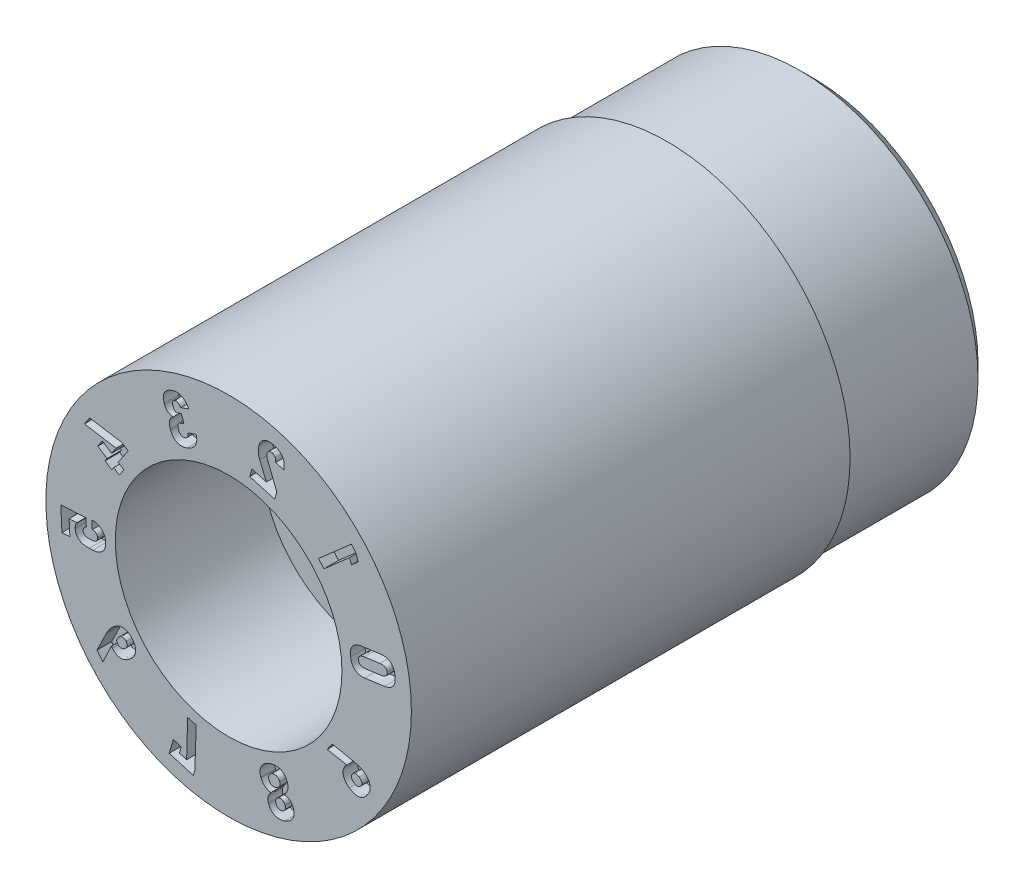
from build123d import *

# Parameters (mm, degrees)
SKETCH4_W          = 2
SKETCH4_H          = 1
CUT_EXTRUDE1_DEPTH = 0.2


with BuildPart() as part:
    # Sketch1 → Revolve1 (revolve)
    with BuildSketch(Plane(origin=(0, 0, 0), x_dir=(0, 0, -1), z_dir=(1, 0, 0)), mode=Mode.PRIVATE) as revolve1_sk:
        Polygon((0, 2.5), (0, 1.55), (2, 1.55), (2, 0.8), (8, 0.8), (8, 2.25), (7.75, 2.5), align=None)
    revolve(revolve1_sk.sketch.rotate(Axis((0, 0, 3.797909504), (0, 0, -1)), 90), axis=Axis((0, 0, 3.797909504), (0, 0, -1)))

    # Sketch4 → Cut-Revolve1 (revolve, cut)
    with BuildSketch(Plane(origin=(0, 0, 0), x_dir=(0, 0, -1), z_dir=(1, 0, 0)), mode=Mode.PRIVATE) as cut_revolve1_sk:
        with Locations((7, 2.935)):
            Rectangle(SKETCH4_W, SKETCH4_H)
    revolve(cut_revolve1_sk.sketch.rotate(Axis((0, 0, 0), (0, 0, -1)), 90), axis=Axis((0, 0, 0), (0, 0, -1)), mode=Mode.SUBTRACT)

    # Sketch6 → Cut-Extrude1 (cut)
    # profile 1 of 10: a face of its own
    with BuildSketch(Plane.XY):
        with BuildLine():
            Line((1.861146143, 0.075596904), (2.131380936, 0.11295078))
            add(Edge.make_bspline(
                [(2.131380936, 0.11295078), (2.144006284, 0.114856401), (2.16249984, 0.118359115), (2.185447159, 0.126664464), (2.201025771, 0.133735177), (2.215151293, 0.142395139), (2.228138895, 0.152100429), (2.239721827, 0.163182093), (2.249926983, 0.175526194), (2.258659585, 0.189055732), (2.265992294, 0.203677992), (2.271567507, 0.219458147), (2.275598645, 0.236316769), (2.278038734, 0.25424988), (2.279141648, 0.280326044), (2.277817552, 0.300406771), (2.275777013, 0.314015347)],
                knots=[0, 0, 0, 0, 0.136085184, 0.199106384, 0.259270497, 0.317759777, 0.37500963, 0.431454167, 0.487863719, 0.545010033, 0.602410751, 0.661485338, 0.72263664, 0.786518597, 0.853705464, 1, 1, 1, 1], degree=3))
            add(Edge.make_bspline(
                [(2.275777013, 0.314015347), (2.273803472, 0.327683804), (2.269967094, 0.347525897), (2.261790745, 0.372400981), (2.254564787, 0.389037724), (2.246152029, 0.404231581), (2.236398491, 0.417856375), (2.225585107, 0.430063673), (2.213533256, 0.440701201), (2.200369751, 0.449682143), (2.18636457, 0.457355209), (2.171245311, 0.463042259), (2.155307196, 0.467594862), (2.138359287, 0.470240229), (2.113893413, 0.471662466), (2.095087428, 0.47052806), (2.082355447, 0.468698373)],
                knots=[0, 0, 0, 0, 0.146845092, 0.214046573, 0.277872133, 0.339327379, 0.39823759, 0.455574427, 0.512279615, 0.568566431, 0.624619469, 0.681531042, 0.739841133, 0.800492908, 0.863366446, 1, 1, 1, 1], degree=3))
            Line((2.082355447, 0.468698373), (1.812120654, 0.431344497))
            add(Edge.make_bspline(
                [(1.812120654, 0.431344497), (1.799495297, 0.429438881), (1.781001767, 0.425936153), (1.758054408, 0.417630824), (1.742475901, 0.410560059), (1.728350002, 0.401900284), (1.715363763, 0.39219432), (1.703775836, 0.381115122), (1.693589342, 0.368761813), (1.684784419, 0.355264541), (1.677718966, 0.340506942), (1.672071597, 0.324760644), (1.668046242, 0.307892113), (1.665659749, 0.28994708), (1.66422147, 0.263870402), (1.666056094, 0.243784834), (1.667757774, 0.230162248)],
                knots=[0, 0, 0, 0, 0.136066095, 0.199078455, 0.259234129, 0.317715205, 0.374957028, 0.431393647, 0.487795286, 0.544933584, 0.60235899, 0.661425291, 0.722568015, 0.786441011, 0.853756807, 1, 1, 1, 1], degree=3))
            add(Edge.make_bspline(
                [(1.667757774, 0.230162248), (1.669802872, 0.21651949), (1.673436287, 0.19660243), (1.681934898, 0.171798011), (1.689022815, 0.155083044), (1.697689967, 0.140019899), (1.707345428, 0.126345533), (1.718316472, 0.114214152), (1.730475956, 0.103608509), (1.743751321, 0.094640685), (1.757899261, 0.087093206), (1.772984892, 0.08111419), (1.788992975, 0.076938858), (1.80578758, 0.074060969), (1.829988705, 0.072633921), (1.848571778, 0.073899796), (1.861146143, 0.075596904)],
                knots=[0, 0, 0, 0, 0.147056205, 0.214375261, 0.278722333, 0.339947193, 0.398942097, 0.456552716, 0.513575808, 0.570221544, 0.62666766, 0.683922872, 0.742464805, 0.802418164, 0.864972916, 1, 1, 1, 1], degree=3))
        make_face()
        with BuildLine():
            Line((1.856182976, 0.323334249), (2.069218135, 0.352683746))
            add(Edge.make_bspline(
                [(2.069218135, 0.352683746), (2.082011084, 0.354526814), (2.100577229, 0.355576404), (2.123617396, 0.351697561), (2.135633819, 0.347440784), (2.143813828, 0.342596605), (2.149235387, 0.338361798), (2.154049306, 0.333495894), (2.158225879, 0.327930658), (2.161610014, 0.321648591), (2.165294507, 0.312126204), (2.167001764, 0.304468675), (2.167780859, 0.299177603)],
                knots=[0, 0, 0, 0, 0.304027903, 0.431521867, 0.546510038, 0.600639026, 0.654019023, 0.70753598, 0.760830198, 0.816755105, 0.874435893, 1, 1, 1, 1], degree=3))
            add(Edge.make_bspline(
                [(2.167780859, 0.299177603), (2.168647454, 0.293868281), (2.168885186, 0.286054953), (2.167890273, 0.275936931), (2.166325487, 0.269001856), (2.163791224, 0.262537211), (2.16044172, 0.256582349), (2.156356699, 0.251080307), (2.149765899, 0.244184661), (2.139402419, 0.23671046), (2.118332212, 0.226522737), (2.100073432, 0.222835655), (2.087318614, 0.220961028)],
                knots=[0, 0, 0, 0, 0.125997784, 0.182684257, 0.238360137, 0.292332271, 0.345112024, 0.398323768, 0.452810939, 0.568510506, 0.695956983, 1, 1, 1, 1], degree=3))
            Line((2.087318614, 0.220961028), (1.874283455, 0.191611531))
            add(Edge.make_bspline(
                [(1.874283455, 0.191611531), (1.861452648, 0.18982522), (1.842882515, 0.188637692), (1.81981419, 0.19259307), (1.807858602, 0.196971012), (1.799657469, 0.201817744), (1.794262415, 0.206003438), (1.789548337, 0.210887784), (1.785411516, 0.216362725), (1.782054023, 0.222613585), (1.778139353, 0.23200655), (1.77657698, 0.239728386), (1.775753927, 0.244999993)],
                knots=[0, 0, 0, 0, 0.305399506, 0.432223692, 0.547953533, 0.602164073, 0.655624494, 0.707922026, 0.761296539, 0.816372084, 0.874242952, 1, 1, 1, 1], degree=3))
            add(Edge.make_bspline(
                [(1.775753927, 0.244999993), (1.774346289, 0.255039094), (1.77464878, 0.270216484), (1.782471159, 0.288124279), (1.791737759, 0.298878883), (1.804011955, 0.307523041), (1.825074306, 0.317785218), (1.843397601, 0.321432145), (1.856182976, 0.323334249)],
                knots=[0, 0, 0, 0, 0.239112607, 0.34504082, 0.452478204, 0.56778046, 0.695160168, 1, 1, 1, 1], degree=3))
        make_face(mode=Mode.SUBTRACT)
    # profile 2 of 10: a face of its own
    with BuildSketch(Plane.XY):
        Polygon((1.229514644, 1.176097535), (1.303909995, 1.091285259), (1.653796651, 1.398438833), (1.68118292, 1.325631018), (1.771031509, 1.404541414), (1.74245543, 1.498226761), (1.67887881, 1.570633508), align=None)
    # profile 3 of 10: a face of its own
    with BuildSketch(Plane.XY):
        with BuildLine():
            Line((0.658529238, 1.677527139), (0.534220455, 1.994587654))
            add(Edge.make_bspline(
                [(0.534220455, 1.994587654), (0.528803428, 2.007944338), (0.524246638, 2.025350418), (0.522754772, 2.046220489), (0.522984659, 2.058502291), (0.524383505, 2.067341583), (0.525900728, 2.072926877)],
                knots=[0, 0, 0, 0, 0.540331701, 0.666219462, 0.783312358, 1, 1, 1, 1], degree=3))
            add(Edge.make_bspline(
                [(0.525900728, 2.072926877), (0.528167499, 2.08077042), (0.532531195, 2.090825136), (0.542560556, 2.10080505), (0.551387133, 2.10597817), (0.561497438, 2.109229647), (0.577377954, 2.110827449), (0.589735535, 2.108376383), (0.598037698, 2.106078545)],
                knots=[0, 0, 0, 0, 0.245514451, 0.356498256, 0.468910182, 0.585213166, 0.70980326, 1, 1, 1, 1], degree=3))
            add(Edge.make_bspline(
                [(0.598037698, 2.106078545), (0.606286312, 2.103702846), (0.618243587, 2.098397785), (0.630250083, 2.086421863), (0.637222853, 2.076028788), (0.641964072, 2.063958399), (0.64554962, 2.045144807), (0.644329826, 2.030171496), (0.64272184, 2.020046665)],
                knots=[0, 0, 0, 0, 0.240931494, 0.353956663, 0.468879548, 0.58751771, 0.712959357, 1, 1, 1, 1], degree=3))
            Line((0.64272184, 2.020046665), (0.754291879, 1.987958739))
            add(Edge.make_bspline(
                [(0.754291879, 1.987958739), (0.758228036, 2.005699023), (0.761170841, 2.031489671), (0.759751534, 2.065260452), (0.755297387, 2.088588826), (0.748494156, 2.110527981), (0.738810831, 2.130790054), (0.726368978, 2.149179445), (0.711453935, 2.165800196), (0.694053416, 2.180455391), (0.667115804, 2.197390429), (0.644430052, 2.206299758), (0.62862663, 2.210811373)],
                knots=[0, 0, 0, 0, 0.185460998, 0.271331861, 0.354080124, 0.43423889, 0.512035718, 0.58907357, 0.666709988, 0.745913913, 0.827271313, 1, 1, 1, 1], degree=3))
            add(Edge.make_bspline(
                [(0.62862663, 2.210811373), (0.61180354, 2.215383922), (0.586854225, 2.220838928), (0.553964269, 2.221731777), (0.531482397, 2.219877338), (0.510496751, 2.215150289), (0.491115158, 2.20777096), (0.473478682, 2.197636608), (0.457747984, 2.184710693), (0.443733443, 2.169420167), (0.427457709, 2.144822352), (0.419239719, 2.123607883), (0.414948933, 2.108802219)],
                knots=[0, 0, 0, 0, 0.195014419, 0.28286785, 0.366387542, 0.446162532, 0.522132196, 0.597030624, 0.672126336, 0.748498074, 0.827697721, 1, 1, 1, 1], degree=3))
            add(Edge.make_bspline(
                [(0.414948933, 2.108802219), (0.411070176, 2.095190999), (0.407351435, 2.07492771), (0.405605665, 2.047354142), (0.406201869, 2.026315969), (0.408436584, 2.005338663), (0.413229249, 1.977879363), (0.419645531, 1.958009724), (0.424866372, 1.945211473)],
                knots=[0, 0, 0, 0, 0.245990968, 0.370324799, 0.497769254, 0.625118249, 0.750585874, 1, 1, 1, 1], degree=3))
            Line((0.424866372, 1.945211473), (0.5160938, 1.725264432))
            Line((0.5160938, 1.725264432), (0.318510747, 1.781245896))
            Line((0.318510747, 1.781245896), (0.288778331, 1.676270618))
            Line((0.288778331, 1.676270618), (0.630672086, 1.579300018))
            Line((0.630672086, 1.579300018), (0.658529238, 1.677527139))
        make_face()
    # profile 4 of 10: a face of its own
    with BuildSketch(Plane.XY):
        with BuildLine():
            Line((-0.444660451, 1.809894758), (-0.55503925, 1.770398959))
            add(Edge.make_bspline(
                [(-0.55503925, 1.770398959), (-0.553554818, 1.764614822), (-0.552886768, 1.755975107), (-0.553027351, 1.74466663), (-0.55448445, 1.736873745), (-0.55661121, 1.729476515), (-0.559722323, 1.722618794), (-0.563683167, 1.71634667), (-0.56832848, 1.710572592), (-0.573809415, 1.705375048), (-0.582576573, 1.699416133), (-0.589831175, 1.695785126), (-0.595052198, 1.69399068)],
                knots=[0, 0, 0, 0, 0.186572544, 0.271920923, 0.35462121, 0.434944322, 0.513458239, 0.590451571, 0.667604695, 0.745940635, 0.82692544, 1, 1, 1, 1], degree=3))
            add(Edge.make_bspline(
                [(-0.595052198, 1.69399068), (-0.604156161, 1.690801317), (-0.618081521, 1.687551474), (-0.636258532, 1.689468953), (-0.648283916, 1.693633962), (-0.659113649, 1.700489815), (-0.671900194, 1.713896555), (-0.678539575, 1.726702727), (-0.681688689, 1.736030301)],
                knots=[0, 0, 0, 0, 0.265794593, 0.382655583, 0.496402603, 0.611511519, 0.730293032, 1, 1, 1, 1], degree=3))
            Line((-0.681688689, 1.736030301), (-0.686487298, 1.74934746))
            add(Edge.make_bspline(
                [(-0.686487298, 1.74934746), (-0.689682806, 1.758966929), (-0.693879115, 1.773203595), (-0.693711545, 1.791882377), (-0.691460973, 1.803893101), (-0.686757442, 1.814489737), (-0.677033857, 1.826783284), (-0.666344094, 1.832542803), (-0.658855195, 1.835198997)],
                knots=[0, 0, 0, 0, 0.299684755, 0.427918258, 0.545279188, 0.656050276, 0.764944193, 1, 1, 1, 1], degree=3))
            Line((-0.658855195, 1.835198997), (-0.610810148, 1.852464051))
            Line((-0.610810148, 1.852464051), (-0.647714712, 1.955470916))
            Line((-0.647714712, 1.955470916), (-0.69575976, 1.938205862))
            add(Edge.make_bspline(
                [(-0.69575976, 1.938205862), (-0.701893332, 1.935884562), (-0.711707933, 1.934546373), (-0.724328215, 1.937541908), (-0.732905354, 1.942294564), (-0.740879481, 1.949078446), (-0.750799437, 1.961731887), (-0.75633488, 1.973137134), (-0.759172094, 1.981484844)],
                knots=[0, 0, 0, 0, 0.227214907, 0.333285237, 0.444905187, 0.564191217, 0.694311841, 1, 1, 1, 1], degree=3))
            Line((-0.759172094, 1.981484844), (-0.76258074, 1.991193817))
            add(Edge.make_bspline(
                [(-0.76258074, 1.991193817), (-0.765168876, 1.999018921), (-0.768514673, 2.010741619), (-0.767661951, 2.026115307), (-0.7650804, 2.036050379), (-0.760535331, 2.044900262), (-0.751416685, 2.055228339), (-0.742034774, 2.060347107), (-0.73529079, 2.062659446)],
                knots=[0, 0, 0, 0, 0.287470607, 0.41213855, 0.528295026, 0.640068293, 0.752902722, 1, 1, 1, 1], degree=3))
            add(Edge.make_bspline(
                [(-0.73529079, 2.062659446), (-0.7306804, 2.064322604), (-0.723451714, 2.066052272), (-0.713626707, 2.065835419), (-0.706282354, 2.064863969), (-0.69906821, 2.062558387), (-0.691928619, 2.059601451), (-0.68504733, 2.055432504), (-0.678346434, 2.050395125), (-0.671964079, 2.044281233), (-0.663404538, 2.034816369), (-0.6581614, 2.026425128), (-0.654822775, 2.020605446)],
                knots=[0, 0, 0, 0, 0.148696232, 0.221310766, 0.296364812, 0.371933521, 0.449683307, 0.529630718, 0.614556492, 0.702791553, 0.796563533, 1, 1, 1, 1], degree=3))
            Line((-0.654822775, 2.020605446), (-0.544804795, 2.059962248))
            add(Edge.make_bspline(
                [(-0.544804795, 2.059962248), (-0.552152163, 2.07580467), (-0.565047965, 2.098115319), (-0.586732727, 2.123739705), (-0.604203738, 2.139809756), (-0.623119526, 2.153042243), (-0.643037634, 2.163647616), (-0.664095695, 2.171016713), (-0.685892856, 2.175678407), (-0.708274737, 2.177353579), (-0.738944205, 2.175797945), (-0.761629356, 2.170232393), (-0.776348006, 2.164936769)],
                knots=[0, 0, 0, 0, 0.185877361, 0.272167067, 0.356231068, 0.437645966, 0.517122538, 0.595493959, 0.674175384, 0.753593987, 0.833544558, 1, 1, 1, 1], degree=3))
            add(Edge.make_bspline(
                [(-0.776348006, 2.164936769), (-0.78825934, 2.160714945), (-0.805273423, 2.153393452), (-0.826040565, 2.141354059), (-0.839712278, 2.131749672), (-0.851811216, 2.121263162), (-0.862615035, 2.110100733), (-0.871705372, 2.097929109), (-0.879301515, 2.085027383), (-0.885338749, 2.071445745), (-0.889751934, 2.057267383), (-0.892574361, 2.042532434), (-0.893670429, 2.027251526), (-0.89304942, 2.011419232), (-0.88992552, 1.989047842), (-0.88517721, 1.972317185), (-0.881253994, 1.96118231)],
                knots=[0, 0, 0, 0, 0.145411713, 0.212404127, 0.275882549, 0.337327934, 0.396364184, 0.454255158, 0.511665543, 0.568287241, 0.62486426, 0.682142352, 0.740515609, 0.800728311, 0.864104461, 1, 1, 1, 1], degree=3))
            Line((-0.881253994, 1.96118231), (-0.875004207, 1.943990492))
            add(Edge.make_bspline(
                [(-0.875004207, 1.943990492), (-0.870550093, 1.93158845), (-0.861830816, 1.91388677), (-0.844973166, 1.89435721), (-0.830791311, 1.882093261), (-0.814838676, 1.872208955), (-0.791002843, 1.862455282), (-0.771563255, 1.859379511), (-0.758363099, 1.859020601)],
                knots=[0, 0, 0, 0, 0.257292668, 0.378794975, 0.500450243, 0.621221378, 0.742700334, 1, 1, 1, 1], degree=3))
            add(Edge.make_bspline(
                [(-0.758363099, 1.859020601), (-0.764463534, 1.855198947), (-0.772832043, 1.848611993), (-0.782884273, 1.83877526), (-0.789222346, 1.83073811), (-0.794948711, 1.822285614), (-0.799566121, 1.813157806), (-0.803503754, 1.803551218), (-0.806511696, 1.793423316), (-0.808801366, 1.782897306), (-0.809936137, 1.771960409), (-0.81040486, 1.760722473), (-0.809643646, 1.749153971), (-0.808362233, 1.737266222), (-0.804980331, 1.720677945), (-0.801258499, 1.708276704), (-0.798248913, 1.699995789)],
                knots=[0, 0, 0, 0, 0.120732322, 0.178523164, 0.23587812, 0.292425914, 0.349801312, 0.40741331, 0.466678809, 0.527112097, 0.588140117, 0.6512167, 0.71587237, 0.782742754, 0.851997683, 1, 1, 1, 1], degree=3))
            Line((-0.798248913, 1.699995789), (-0.792093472, 1.682726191))
            add(Edge.make_bspline(
                [(-0.792093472, 1.682726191), (-0.786598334, 1.66733785), (-0.776421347, 1.645603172), (-0.758111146, 1.620431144), (-0.742786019, 1.605002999), (-0.725957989, 1.592154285), (-0.70741052, 1.582414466), (-0.687411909, 1.575484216), (-0.665978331, 1.571545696), (-0.643291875, 1.57072338), (-0.610508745, 1.573334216), (-0.585949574, 1.580242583), (-0.569571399, 1.586002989)],
                knots=[0, 0, 0, 0, 0.177849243, 0.25911894, 0.337485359, 0.413633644, 0.488574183, 0.564396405, 0.64308834, 0.724730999, 0.81071855, 1, 1, 1, 1], degree=3))
            add(Edge.make_bspline(
                [(-0.569571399, 1.586002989), (-0.553279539, 1.591904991), (-0.52987392, 1.602479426), (-0.502364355, 1.621545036), (-0.484333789, 1.637040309), (-0.468916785, 1.654311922), (-0.456339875, 1.673177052), (-0.446450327, 1.693418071), (-0.439622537, 1.715055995), (-0.435696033, 1.737755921), (-0.435318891, 1.76988641), (-0.439725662, 1.794047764), (-0.444660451, 1.809894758)],
                knots=[0, 0, 0, 0, 0.181603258, 0.266805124, 0.34959229, 0.42989784, 0.508309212, 0.586193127, 0.664882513, 0.745024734, 0.82641524, 1, 1, 1, 1], degree=3))
        make_face()
    # profile 5 of 10: a face of its own
    with BuildSketch(Plane.XY):
        Polygon((-1.461983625, 1.206066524), (-1.901222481, 1.276213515), (-1.972361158, 1.169655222), (-1.540026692, 1.097958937), (-1.600776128, 1.006885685), (-1.727297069, 1.091268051), (-1.790182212, 0.997018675), (-1.663649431, 0.912628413), (-1.689842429, 0.873360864), (-1.598940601, 0.81279081), (-1.572781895, 0.852024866), (-1.49574574, 0.800646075), (-1.432860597, 0.894895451), (-1.509928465, 0.946295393), (-1.375275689, 1.148253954), align=None)
    # profile 6 of 10: a face of its own
    with BuildSketch(Plane.XY):
        with BuildLine():
            Line((-1.870101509, 0.084380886), (-1.864984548, -0.02864355))
            add(Edge.make_bspline(
                [(-1.864984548, -0.02864355), (-1.854592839, -0.029394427), (-1.839962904, -0.031292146), (-1.822676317, -0.038748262), (-1.812086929, -0.045885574), (-1.803502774, -0.05469836), (-1.794710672, -0.068764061), (-1.791957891, -0.081191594), (-1.791646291, -0.08960772)],
                knots=[0, 0, 0, 0, 0.286811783, 0.412879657, 0.53217682, 0.647646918, 0.760112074, 1, 1, 1, 1], degree=3))
            add(Edge.make_bspline(
                [(-1.791646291, -0.08960772), (-1.791125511, -0.09854759), (-1.792438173, -0.111971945), (-1.800350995, -0.127436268), (-1.808563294, -0.136969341), (-1.81910434, -0.144706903), (-1.83697356, -0.152859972), (-1.852334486, -0.154958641), (-1.862917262, -0.155606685)],
                knots=[0, 0, 0, 0, 0.245303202, 0.356179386, 0.46847524, 0.585010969, 0.709668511, 1, 1, 1, 1], degree=3))
            Line((-1.862917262, -0.155606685), (-1.91316959, -0.158101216))
            add(Edge.make_bspline(
                [(-1.91316959, -0.158101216), (-1.923714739, -0.158417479), (-1.939041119, -0.158068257), (-1.957581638, -0.152473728), (-1.968687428, -0.146519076), (-1.977674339, -0.138798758), (-1.9867658, -0.125837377), (-1.989410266, -0.113934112), (-1.989817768, -0.105940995)],
                knots=[0, 0, 0, 0, 0.303706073, 0.432972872, 0.551519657, 0.662220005, 0.769409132, 1, 1, 1, 1], degree=3))
            add(Edge.make_bspline(
                [(-1.989817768, -0.105940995), (-1.990277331, -0.098328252), (-1.989259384, -0.087108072), (-1.984731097, -0.07309281), (-1.979733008, -0.063755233), (-1.973294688, -0.055446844), (-1.962584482, -0.045920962), (-1.952951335, -0.040773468), (-1.945968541, -0.038466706)],
                knots=[0, 0, 0, 0, 0.263247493, 0.384983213, 0.506898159, 0.627478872, 0.746393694, 1, 1, 1, 1], degree=3))
            Line((-1.945968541, -0.038466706), (-1.951217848, 0.067172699))
            Line((-1.951217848, 0.067172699), (-2.296145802, 0.050139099))
            Line((-2.296145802, 0.050139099), (-2.280235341, -0.272169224))
            Line((-2.280235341, -0.272169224), (-2.171298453, -0.26671785))
            Line((-2.171298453, -0.26671785), (-2.181593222, -0.057507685))
            Line((-2.181593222, -0.057507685), (-2.075576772, -0.052344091))
            add(Edge.make_bspline(
                [(-2.075576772, -0.052344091), (-2.079949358, -0.056909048), (-2.084715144, -0.065383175), (-2.090416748, -0.077539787), (-2.096785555, -0.098741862), (-2.099304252, -0.117400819), (-2.098529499, -0.132380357)],
                knots=[0, 0, 0, 0, 0.220538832, 0.341672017, 0.473116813, 1, 1, 1, 1], degree=3))
            add(Edge.make_bspline(
                [(-2.098529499, -0.132380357), (-2.097872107, -0.146985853), (-2.094345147, -0.16830697), (-2.083899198, -0.194380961), (-2.073537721, -0.211504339), (-2.060568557, -0.226540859), (-2.045444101, -0.239812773), (-2.027585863, -0.250408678), (-2.007666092, -0.259255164), (-1.985472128, -0.26566038), (-1.952001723, -0.271546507), (-1.925625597, -0.271943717), (-1.907565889, -0.271077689)],
                knots=[0, 0, 0, 0, 0.164054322, 0.239859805, 0.31388788, 0.387451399, 0.461834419, 0.538554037, 0.619422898, 0.705768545, 0.796958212, 1, 1, 1, 1], degree=3))
            Line((-1.907565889, -0.271077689), (-1.857313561, -0.268583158))
            add(Edge.make_bspline(
                [(-1.857313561, -0.268583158), (-1.839245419, -0.267493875), (-1.812859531, -0.264287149), (-1.780251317, -0.253604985), (-1.758866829, -0.243427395), (-1.739891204, -0.230779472), (-1.723334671, -0.215955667), (-1.709444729, -0.198731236), (-1.698331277, -0.179300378), (-1.689772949, -0.157836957), (-1.682009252, -0.125566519), (-1.68106542, -0.099907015), (-1.681891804, -0.082478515)],
                knots=[0, 0, 0, 0, 0.18726901, 0.272209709, 0.35328063, 0.431030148, 0.50686111, 0.581846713, 0.658451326, 0.737122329, 0.819636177, 1, 1, 1, 1], degree=3))
            add(Edge.make_bspline(
                [(-1.681891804, -0.082478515), (-1.682848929, -0.067121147), (-1.686090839, -0.044256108), (-1.696825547, -0.015963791), (-1.707124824, 0.003559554), (-1.719802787, 0.021448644), (-1.73503463, 0.037330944), (-1.752695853, 0.051014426), (-1.772463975, 0.062758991), (-1.794315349, 0.072153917), (-1.826770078, 0.081369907), (-1.85253136, 0.08409151), (-1.870101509, 0.084380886)],
                knots=[0, 0, 0, 0, 0.16518758, 0.244702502, 0.323004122, 0.401020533, 0.478735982, 0.557771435, 0.63957408, 0.724366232, 0.811743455, 1, 1, 1, 1], degree=3))
        make_face()
    # profile 7 of 10: a face of its own
    with BuildSketch(Plane.XY):
        with BuildLine():
            Line((-1.673850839, -1.166022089), (-1.8006326, -1.423705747))
            Line((-1.8006326, -1.423705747), (-1.720474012, -1.524282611))
            Line((-1.720474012, -1.524282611), (-1.601794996, -1.277186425))
            add(Edge.make_bspline(
                [(-1.601794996, -1.277186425), (-1.598402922, -1.2837164), (-1.594215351, -1.289842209), (-1.589691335, -1.295619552)],
                knots=[0.758865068, 0.758865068, 0.758865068, 0.758865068, 1, 1, 1, 1], degree=3))
            add(Edge.make_bspline(
                [(-1.589691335, -1.295619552), (-1.580032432, -1.307779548), (-1.564091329, -1.324281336), (-1.539270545, -1.34060225), (-1.520394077, -1.349606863), (-1.500593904, -1.355238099), (-1.480209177, -1.357848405), (-1.459252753, -1.356876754), (-1.437842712, -1.353116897), (-1.416040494, -1.346047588), (-1.385855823, -1.331837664), (-1.364393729, -1.317442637), (-1.350650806, -1.306340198)],
                knots=[0, 0, 0, 0, 0.171750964, 0.250484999, 0.326915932, 0.401720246, 0.476805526, 0.552775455, 0.632420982, 0.716150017, 0.804985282, 1, 1, 1, 1], degree=3))
            add(Edge.make_bspline(
                [(-1.350650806, -1.306340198), (-1.336461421, -1.294722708), (-1.316923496, -1.276779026), (-1.296729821, -1.249066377), (-1.285243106, -1.22832099), (-1.276916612, -1.207003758), (-1.272350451, -1.185197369), (-1.271037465, -1.16313547), (-1.273363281, -1.14085727), (-1.278934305, -1.118496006), (-1.291660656, -1.087999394), (-1.305422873, -1.066551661), (-1.316474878, -1.053113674)],
                knots=[0, 0, 0, 0, 0.187231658, 0.271998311, 0.353495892, 0.431801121, 0.507661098, 0.582894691, 0.659382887, 0.738345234, 0.820299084, 1, 1, 1, 1], degree=3))
            add(Edge.make_bspline(
                [(-1.316474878, -1.053113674), (-1.32725543, -1.039542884), (-1.344832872, -1.021101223), (-1.371787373, -1.002101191), (-1.39221175, -0.991577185), (-1.413272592, -0.984240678), (-1.434914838, -0.980473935), (-1.457001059, -0.979898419), (-1.479385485, -0.983120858), (-1.501967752, -0.989431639), (-1.533062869, -1.003029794), (-1.554895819, -1.017616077), (-1.568948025, -1.028770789)],
                knots=[0, 0, 0, 0, 0.180537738, 0.262924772, 0.342136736, 0.418908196, 0.494080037, 0.569860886, 0.647850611, 0.728517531, 0.813183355, 1, 1, 1, 1], degree=3))
            add(Edge.make_bspline(
                [(-1.568948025, -1.028770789), (-1.577967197, -1.03621901), (-1.590953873, -1.047569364), (-1.606737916, -1.064761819), (-1.631470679, -1.093254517), (-1.648699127, -1.120221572), (-1.661523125, -1.142381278)],
                knots=[0, 0, 0, 0, 0.229993, 0.351155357, 0.476209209, 1, 1, 1, 1], degree=3))
            add(Edge.make_bspline(
                [(-1.661523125, -1.142381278), (-1.663758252, -1.14628713), (-1.668224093, -1.153983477), (-1.672057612, -1.162015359), (-1.673850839, -1.166022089)],
                knots=[0, 0, 0, 0, 0.506239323, 1, 1, 1, 1], degree=3))
        make_face()
        with BuildLine():
            add(Edge.make_bspline(
                [(-1.402153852, -1.121387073), (-1.396648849, -1.128478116), (-1.389395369, -1.139851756), (-1.386151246, -1.156768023), (-1.386453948, -1.168911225), (-1.389783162, -1.180807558), (-1.398199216, -1.196748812), (-1.408211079, -1.206737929), (-1.415725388, -1.212739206)],
                knots=[0, 0, 0, 0, 0.259220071, 0.373991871, 0.488033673, 0.603495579, 0.723903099, 1, 1, 1, 1], degree=3))
            add(Edge.make_bspline(
                [(-1.415725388, -1.212739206), (-1.424919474, -1.219760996), (-1.43824468, -1.228922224), (-1.457737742, -1.235114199), (-1.471173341, -1.236599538), (-1.483986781, -1.235011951), (-1.500339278, -1.228451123), (-1.510534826, -1.219478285), (-1.516108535, -1.212274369)],
                knots=[0, 0, 0, 0, 0.29439702, 0.420614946, 0.537999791, 0.649665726, 0.75877908, 1, 1, 1, 1], degree=3))
            add(Edge.make_bspline(
                [(-1.516108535, -1.212274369), (-1.521950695, -1.205263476), (-1.528279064, -1.193251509), (-1.531049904, -1.17576109), (-1.529462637, -1.162817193), (-1.52489634, -1.150004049), (-1.514504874, -1.132385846), (-1.502761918, -1.121330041), (-1.49414926, -1.114442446)],
                knots=[0, 0, 0, 0, 0.240459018, 0.350226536, 0.462943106, 0.581009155, 0.707347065, 1, 1, 1, 1], degree=3))
            add(Edge.make_bspline(
                [(-1.49414926, -1.114442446), (-1.486443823, -1.108231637), (-1.47447028, -1.100706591), (-1.457065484, -1.095985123), (-1.444770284, -1.095588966), (-1.432920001, -1.097942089), (-1.417227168, -1.104895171), (-1.407820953, -1.114492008), (-1.402153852, -1.121387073)],
                knots=[0, 0, 0, 0, 0.276884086, 0.398103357, 0.512857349, 0.626223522, 0.741688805, 1, 1, 1, 1], degree=3))
        make_face(mode=Mode.SUBTRACT)
    # profile 8 of 10: a face of its own
    with BuildSketch(Plane.XY):
        Polygon((-0.461953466, -2.177533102), (-0.442808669, -1.634135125), (-0.560806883, -1.599543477), (-0.574237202, -2.109126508), (-0.673621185, -2.079939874), (-0.648015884, -1.992931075), (-0.756776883, -1.96092445), (-0.813202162, -2.152806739), (-0.483237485, -2.249881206), align=None)
    # profile 9 of 10: a face of its own
    with BuildSketch(Plane.XY):
        with BuildLine():
            Line((0.440172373, -1.806807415), (0.44346975, -1.816101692))
            add(Edge.make_bspline(
                [(0.44346975, -1.816101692), (0.44838488, -1.8300312), (0.458760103, -1.849965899), (0.478061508, -1.87288697), (0.495069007, -1.888053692), (0.513717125, -1.901159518), (0.54070896, -1.914759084), (0.562742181, -1.920330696), (0.577676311, -1.92195459)],
                knots=[0, 0, 0, 0, 0.246171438, 0.370574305, 0.497855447, 0.625205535, 0.749638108, 1, 1, 1, 1], degree=3))
            add(Edge.make_bspline(
                [(0.577676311, -1.92195459), (0.568721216, -1.931125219), (0.556880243, -1.946456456), (0.546016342, -1.96963457), (0.540103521, -1.987735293), (0.536799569, -2.006235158), (0.535846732, -2.030624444), (0.539169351, -2.048578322), (0.543329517, -2.059823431)],
                knots=[0, 0, 0, 0, 0.257362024, 0.384265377, 0.511948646, 0.638326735, 0.760010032, 1, 1, 1, 1], degree=3))
            Line((0.543329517, -2.059823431), (0.548578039, -2.074621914))
            add(Edge.make_bspline(
                [(0.548578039, -2.074621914), (0.553594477, -2.08861652), (0.56315796, -2.108659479), (0.581363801, -2.13130169), (0.596780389, -2.145632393), (0.614015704, -2.15746476), (0.63283401, -2.166750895), (0.653223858, -2.173107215), (0.674840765, -2.177044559), (0.697521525, -2.177981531), (0.729629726, -2.175569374), (0.753547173, -2.169071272), (0.769374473, -2.163532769)],
                knots=[0, 0, 0, 0, 0.166823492, 0.245803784, 0.324182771, 0.401755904, 0.479173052, 0.558311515, 0.640213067, 0.724606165, 0.811861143, 1, 1, 1, 1], degree=3))
            add(Edge.make_bspline(
                [(0.769374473, -2.163532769), (0.785159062, -2.157870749), (0.807705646, -2.147592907), (0.834332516, -2.129371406), (0.851232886, -2.114162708), (0.865725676, -2.097687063), (0.87713347, -2.079722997), (0.886094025, -2.060797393), (0.891843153, -2.040707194), (0.894736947, -2.019836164), (0.894317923, -1.990771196), (0.889446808, -1.969113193), (0.884387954, -1.955086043)],
                knots=[0, 0, 0, 0, 0.187886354, 0.275793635, 0.360338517, 0.441912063, 0.52072506, 0.597892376, 0.675636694, 0.753788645, 0.833060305, 1, 1, 1, 1], degree=3))
            Line((0.884387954, -1.955086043), (0.879139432, -1.94028756))
            add(Edge.make_bspline(
                [(0.879139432, -1.94028756), (0.875095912, -1.928806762), (0.866204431, -1.912605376), (0.849909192, -1.894086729), (0.835399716, -1.88198422), (0.819290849, -1.871733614), (0.795937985, -1.861127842), (0.77710083, -1.856741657), (0.764303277, -1.855562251)],
                knots=[0, 0, 0, 0, 0.242255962, 0.364285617, 0.490072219, 0.617829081, 0.743975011, 1, 1, 1, 1], degree=3))
            add(Edge.make_bspline(
                [(0.764303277, -1.855562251), (0.775025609, -1.844794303), (0.788368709, -1.826248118), (0.801213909, -1.798665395), (0.807701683, -1.776702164), (0.811424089, -1.754200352), (0.811950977, -1.72427113), (0.807519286, -1.70229352), (0.802553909, -1.688369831)],
                knots=[0, 0, 0, 0, 0.25190418, 0.37644236, 0.504229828, 0.631392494, 0.754492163, 1, 1, 1, 1], degree=3))
            Line((0.802553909, -1.688369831), (0.799256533, -1.679075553))
            add(Edge.make_bspline(
                [(0.799256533, -1.679075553), (0.794033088, -1.66410078), (0.783516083, -1.643059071), (0.764469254, -1.618811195), (0.748019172, -1.603713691), (0.729667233, -1.591257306), (0.70962898, -1.58152656), (0.688007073, -1.574662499), (0.66487946, -1.570873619), (0.640611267, -1.570015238), (0.606193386, -1.572594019), (0.580590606, -1.579653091), (0.563644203, -1.585502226)],
                knots=[0, 0, 0, 0, 0.16661999, 0.245042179, 0.322974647, 0.400383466, 0.477449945, 0.556366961, 0.638037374, 0.723053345, 0.811132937, 1, 1, 1, 1], degree=3))
            add(Edge.make_bspline(
                [(0.563644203, -1.585502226), (0.546724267, -1.59149888), (0.522582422, -1.602403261), (0.494171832, -1.621916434), (0.476017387, -1.638022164), (0.460684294, -1.655735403), (0.447985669, -1.674533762), (0.438736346, -1.694798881), (0.432426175, -1.716000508), (0.429235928, -1.738112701), (0.429573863, -1.768941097), (0.434901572, -1.791903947), (0.440172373, -1.806807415)],
                knots=[0, 0, 0, 0, 0.188987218, 0.276722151, 0.361703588, 0.443542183, 0.522602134, 0.599494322, 0.676914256, 0.754586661, 0.833600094, 1, 1, 1, 1], degree=3))
        make_face()
        with BuildLine():
            Line((0.698027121, -1.732487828), (0.699978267, -1.737992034))
            add(Edge.make_bspline(
                [(0.699978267, -1.737992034), (0.702332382, -1.743999), (0.704108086, -1.753329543), (0.704416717, -1.765832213), (0.702985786, -1.774805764), (0.700351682, -1.783454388), (0.696518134, -1.791616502), (0.691566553, -1.799334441), (0.685415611, -1.806501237), (0.678112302, -1.813099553), (0.666485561, -1.82084448), (0.656839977, -1.82551852), (0.649915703, -1.827817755)],
                knots=[0, 0, 0, 0, 0.166477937, 0.244771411, 0.323385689, 0.401119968, 0.478695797, 0.556624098, 0.638356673, 0.723073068, 0.811168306, 1, 1, 1, 1], degree=3))
            add(Edge.make_bspline(
                [(0.649915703, -1.827817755), (0.643070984, -1.830250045), (0.63269475, -1.83288946), (0.61881089, -1.833992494), (0.608981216, -1.83362579), (0.59964266, -1.831985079), (0.590875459, -1.829122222), (0.582723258, -1.825154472), (0.575227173, -1.819983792), (0.56845588, -1.813823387), (0.560557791, -1.804072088), (0.556312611, -1.795512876), (0.554182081, -1.789486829)],
                knots=[0, 0, 0, 0, 0.188192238, 0.275451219, 0.359959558, 0.44228378, 0.520170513, 0.598100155, 0.676258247, 0.755231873, 0.834402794, 1, 1, 1, 1], degree=3))
            Line((0.554182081, -1.789486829), (0.552094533, -1.783620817))
            add(Edge.make_bspline(
                [(0.552094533, -1.783620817), (0.549845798, -1.777084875), (0.547392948, -1.767084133), (0.546950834, -1.753607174), (0.548149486, -1.743949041), (0.550626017, -1.734730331), (0.554073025, -1.725884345), (0.559117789, -1.71775238), (0.565301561, -1.710233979), (0.572540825, -1.703368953), (0.583896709, -1.695323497), (0.5934957, -1.690740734), (0.600283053, -1.688385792)],
                knots=[0, 0, 0, 0, 0.172935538, 0.25503735, 0.335717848, 0.41517383, 0.49313368, 0.572065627, 0.653169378, 0.735900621, 0.820596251, 1, 1, 1, 1], degree=3))
            add(Edge.make_bspline(
                [(0.600283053, -1.688385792), (0.607103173, -1.686239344), (0.617402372, -1.683169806), (0.63135966, -1.682747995), (0.641324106, -1.683445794), (0.650883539, -1.685484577), (0.659905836, -1.688732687), (0.668284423, -1.693383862), (0.676052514, -1.699079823), (0.683101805, -1.705929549), (0.691110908, -1.716788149), (0.695763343, -1.725946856), (0.698027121, -1.732487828)],
                knots=[0, 0, 0, 0, 0.179064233, 0.263911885, 0.346470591, 0.427308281, 0.506504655, 0.58434322, 0.665085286, 0.745782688, 0.828047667, 1, 1, 1, 1], degree=3))
        make_face(mode=Mode.SUBTRACT)
        with BuildLine():
            Line((0.770734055, -1.974008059), (0.772608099, -1.979417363))
            add(Edge.make_bspline(
                [(0.772608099, -1.979417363), (0.774599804, -1.985047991), (0.776847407, -1.993681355), (0.777116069, -2.005258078), (0.776433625, -2.013520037), (0.774458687, -2.021360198), (0.77149991, -2.028792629), (0.76741896, -2.035682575), (0.762448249, -2.042189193), (0.75626478, -2.047846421), (0.746869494, -2.054970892), (0.738539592, -2.058632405), (0.732812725, -2.060744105)],
                knots=[0, 0, 0, 0, 0.176161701, 0.259111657, 0.339635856, 0.419226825, 0.495950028, 0.574092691, 0.654052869, 0.735781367, 0.819764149, 1, 1, 1, 1], degree=3))
            add(Edge.make_bspline(
                [(0.732812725, -2.060744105), (0.727034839, -2.0628399), (0.718243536, -2.065081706), (0.706451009, -2.065645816), (0.698058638, -2.06510842), (0.690032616, -2.063283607), (0.682414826, -2.060517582), (0.675428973, -2.056539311), (0.669006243, -2.051513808), (0.663092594, -2.04567747), (0.656203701, -2.036252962), (0.652333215, -2.028232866), (0.650275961, -2.022561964)],
                knots=[0, 0, 0, 0, 0.180117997, 0.262907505, 0.344763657, 0.42542911, 0.502964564, 0.581157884, 0.659569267, 0.741111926, 0.823496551, 1, 1, 1, 1], degree=3))
            Line((0.650275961, -2.022561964), (0.648188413, -2.016695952))
            add(Edge.make_bspline(
                [(0.648188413, -2.016695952), (0.646286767, -2.010723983), (0.643725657, -2.001728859), (0.643284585, -1.989545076), (0.643880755, -1.980856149), (0.645571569, -1.972537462), (0.648443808, -1.9647377), (0.652322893, -1.95745394), (0.657327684, -1.950737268), (0.663237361, -1.944640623), (0.672702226, -1.937445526), (0.680910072, -1.933516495), (0.686732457, -1.931502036)],
                knots=[0, 0, 0, 0, 0.179592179, 0.263525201, 0.346584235, 0.427558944, 0.504713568, 0.582868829, 0.662097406, 0.742846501, 0.824253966, 1, 1, 1, 1], degree=3))
            add(Edge.make_bspline(
                [(0.686732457, -1.931502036), (0.692527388, -1.929557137), (0.701342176, -1.927212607), (0.713218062, -1.9269438), (0.721693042, -1.92778843), (0.729828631, -1.929796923), (0.737436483, -1.933168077), (0.744741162, -1.93731661), (0.751318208, -1.942851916), (0.757337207, -1.949278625), (0.764639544, -1.959284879), (0.768490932, -1.968006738), (0.770734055, -1.974008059)],
                knots=[0, 0, 0, 0, 0.173533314, 0.254939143, 0.334836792, 0.413931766, 0.490776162, 0.569584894, 0.650761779, 0.732826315, 0.818271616, 1, 1, 1, 1], degree=3))
        make_face(mode=Mode.SUBTRACT)
    # profile 10 of 10: a face of its own
    with BuildSketch(Plane.XY):
        with BuildLine():
            Line((1.687776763, -0.982634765), (1.415690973, -0.927297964))
            Line((1.415690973, -0.927297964), (1.348832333, -1.025951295))
            Line((1.348832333, -1.025951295), (1.618050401, -1.075954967))
            add(Edge.make_bspline(
                [(1.618050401, -1.075954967), (1.617607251, -1.076311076), (1.614022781, -1.0792318), (1.603976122, -1.088251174), (1.596158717, -1.098663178), (1.591090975, -1.105896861)],
                knots=[0.563738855, 0.563738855, 0.563738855, 0.563738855, 0.582118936, 0.713215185, 1, 1, 1, 1], degree=3))
            add(Edge.make_bspline(
                [(1.591090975, -1.105896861), (1.583177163, -1.11778251), (1.572987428, -1.136624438), (1.566198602, -1.163746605), (1.563934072, -1.183944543), (1.564902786, -1.204181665), (1.568733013, -1.224187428), (1.575482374, -1.243832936), (1.585286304, -1.262932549), (1.597764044, -1.281323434), (1.618320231, -1.305339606), (1.6374452, -1.320336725), (1.650921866, -1.329740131)],
                knots=[0, 0, 0, 0, 0.165011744, 0.24333664, 0.320835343, 0.398344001, 0.475785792, 0.554753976, 0.636794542, 0.722350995, 0.810252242, 1, 1, 1, 1], degree=3))
            add(Edge.make_bspline(
                [(1.650921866, -1.329740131), (1.666208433, -1.340044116), (1.689135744, -1.353202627), (1.721435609, -1.364118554), (1.744452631, -1.368991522), (1.766998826, -1.370381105), (1.788917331, -1.368578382), (1.810100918, -1.363163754), (1.83050306, -1.3544817), (1.850042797, -1.342610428), (1.875261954, -1.321607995), (1.89144673, -1.302109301), (1.901060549, -1.287751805)],
                knots=[0, 0, 0, 0, 0.187845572, 0.273110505, 0.354385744, 0.432278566, 0.50765431, 0.582613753, 0.659076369, 0.737901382, 0.819962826, 1, 1, 1, 1], degree=3))
            add(Edge.make_bspline(
                [(1.901060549, -1.287751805), (1.910621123, -1.273521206), (1.922982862, -1.251414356), (1.932727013, -1.22014244), (1.93661225, -1.197545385), (1.936891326, -1.175311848), (1.93394849, -1.153513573), (1.927242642, -1.132373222), (1.917511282, -1.111728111), (1.904231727, -1.092046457), (1.881823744, -1.066020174), (1.860946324, -1.049529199), (1.846035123, -1.039238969)],
                knots=[0, 0, 0, 0, 0.178213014, 0.260309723, 0.338857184, 0.415272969, 0.490149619, 0.566080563, 0.644482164, 0.726181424, 0.811642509, 1, 1, 1, 1], degree=3))
            add(Edge.make_bspline(
                [(1.846035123, -1.039238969), (1.83705156, -1.033104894), (1.823082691, -1.025212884), (1.803314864, -1.015887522), (1.786965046, -1.009493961), (1.769599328, -1.003516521), (1.74442603, -0.995971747), (1.724946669, -0.990804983), (1.711537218, -0.987801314)],
                knots=[0, 0, 0, 0, 0.216672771, 0.332921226, 0.453958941, 0.581293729, 0.714502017, 1, 1, 1, 1], degree=3))
            add(Edge.make_bspline(
                [(1.711537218, -0.987801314), (1.707547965, -0.986791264), (1.699727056, -0.984602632), (1.691710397, -0.983301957), (1.687776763, -0.982634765)],
                knots=[0, 0, 0, 0, 0.507720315, 1, 1, 1, 1], degree=3))
        make_face()
        with BuildLine():
            add(Edge.make_bspline(
                [(1.691422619, -1.145512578), (1.696371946, -1.138120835), (1.705480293, -1.128400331), (1.720834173, -1.120473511), (1.733127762, -1.117880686), (1.746038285, -1.117944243), (1.764859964, -1.12222805), (1.778257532, -1.129261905), (1.786812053, -1.135254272)],
                knots=[0, 0, 0, 0, 0.245706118, 0.358531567, 0.471222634, 0.588703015, 0.711809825, 1, 1, 1, 1], degree=3))
            add(Edge.make_bspline(
                [(1.786812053, -1.135254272), (1.795454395, -1.141188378), (1.806749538, -1.150564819), (1.817027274, -1.166132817), (1.821626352, -1.177837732), (1.823293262, -1.190016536), (1.821297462, -1.207016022), (1.815678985, -1.218988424), (1.81061355, -1.226317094)],
                knots=[0, 0, 0, 0, 0.28425954, 0.406094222, 0.522079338, 0.635709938, 0.748717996, 1, 1, 1, 1], degree=3))
            add(Edge.make_bspline(
                [(1.81061355, -1.226317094), (1.805527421, -1.233717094), (1.796600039, -1.243762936), (1.781277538, -1.25181783), (1.769258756, -1.254609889), (1.756595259, -1.254839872), (1.738239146, -1.250812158), (1.725163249, -1.244060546), (1.716832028, -1.23830495)],
                knots=[0, 0, 0, 0, 0.252427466, 0.365775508, 0.478543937, 0.594271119, 0.716858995, 1, 1, 1, 1], degree=3))
            add(Edge.make_bspline(
                [(1.716832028, -1.23830495), (1.708027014, -1.232284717), (1.696322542, -1.222599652), (1.68549707, -1.206622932), (1.680650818, -1.194652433), (1.67883803, -1.182302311), (1.68040838, -1.165040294), (1.686433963, -1.152966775), (1.691422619, -1.145512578)],
                knots=[0, 0, 0, 0, 0.28720076, 0.411057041, 0.527710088, 0.639528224, 0.751391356, 1, 1, 1, 1], degree=3))
        make_face(mode=Mode.SUBTRACT)
    extrude(amount=-CUT_EXTRUDE1_DEPTH, mode=Mode.SUBTRACT)


solid = part.part
